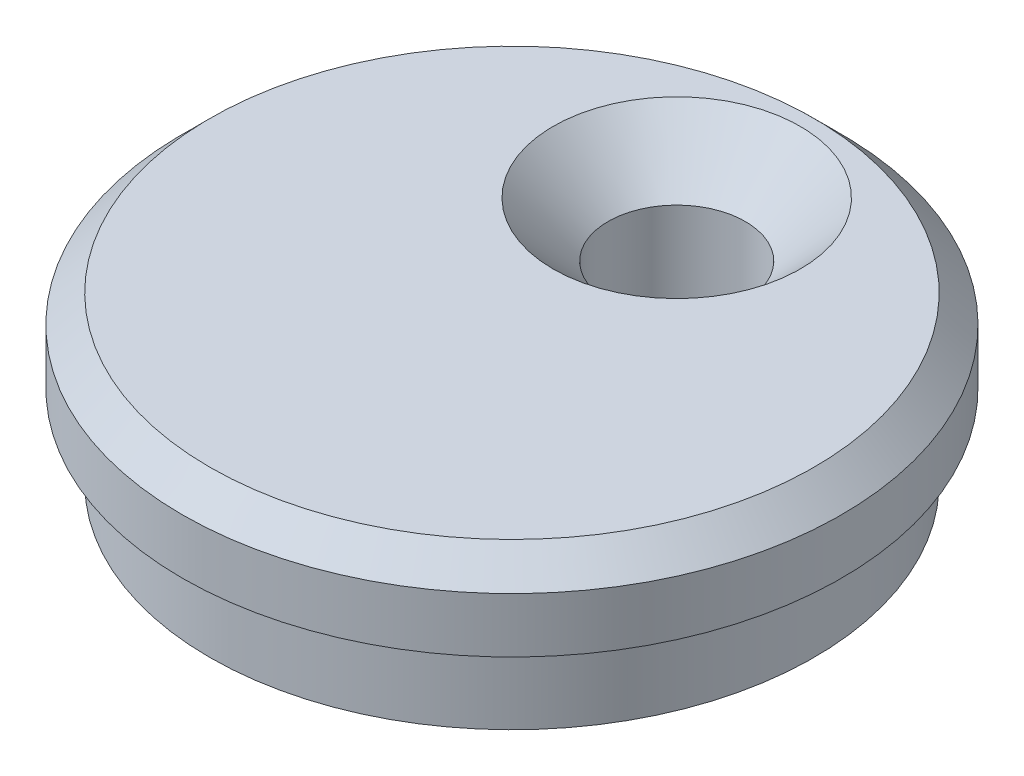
ISO-10303-21;
HEADER;
FILE_DESCRIPTION(('STEP AP214'),'2;1');
FILE_NAME('part.step','',(''),(''),'','','');
FILE_SCHEMA(('AUTOMOTIVE_DESIGN { 1 0 10303 214 1 1 1 1 }'));
ENDSEC;
DATA;
#1=APPLICATION_CONTEXT('core data for automotive mechanical design processes');
#2=APPLICATION_PROTOCOL_DEFINITION('international standard','automotive_design',2000,#1);
#3=PRODUCT_CONTEXT('',#1,'mechanical');
#4=PRODUCT('Part','Part','',(#3));
#5=PRODUCT_RELATED_PRODUCT_CATEGORY('part','',(#4));
#6=PRODUCT_DEFINITION_FORMATION('','',#4);
#7=PRODUCT_DEFINITION_CONTEXT('part definition',#1,'design');
#8=PRODUCT_DEFINITION('design','',#6,#7);
#9=PRODUCT_DEFINITION_SHAPE('','',#8);
#10=(LENGTH_UNIT() NAMED_UNIT(*) SI_UNIT(.MILLI.,.METRE.));
#11=(NAMED_UNIT(*) PLANE_ANGLE_UNIT() SI_UNIT($,.RADIAN.));
#12=(NAMED_UNIT(*) SI_UNIT($,.STERADIAN.) SOLID_ANGLE_UNIT());
#13=UNCERTAINTY_MEASURE_WITH_UNIT(LENGTH_MEASURE(1.E-05),#10,'distance_accuracy_value','');
#14=(GEOMETRIC_REPRESENTATION_CONTEXT(3) GLOBAL_UNCERTAINTY_ASSIGNED_CONTEXT((#13)) GLOBAL_UNIT_ASSIGNED_CONTEXT((#10,
#11,#12)) REPRESENTATION_CONTEXT('',''));
#15=CARTESIAN_POINT('',(0.,0.,0.));
#16=DIRECTION('',(0.,0.,1.));
#17=DIRECTION('',(1.,0.,0.));
#18=AXIS2_PLACEMENT_3D('',#15,#16,#17);
#19=CARTESIAN_POINT('',(0.,3.,0.));
#20=DIRECTION('',(0.,-1.,0.));
#21=DIRECTION('',(0.,0.,-1.));
#22=AXIS2_PLACEMENT_3D('',#19,#20,#21);
#23=CYLINDRICAL_SURFACE('',#22,11.);
#24=CARTESIAN_POINT('',(0.,3.,0.));
#25=DIRECTION('',(0.,1.,0.));
#26=DIRECTION('',(0.,0.,1.));
#27=AXIS2_PLACEMENT_3D('',#24,#25,#26);
#28=CIRCLE('',#27,11.);
#29=CARTESIAN_POINT('',(0.,3.,11.));
#30=VERTEX_POINT('',#29);
#31=EDGE_CURVE('E40',#30,#30,#28,.T.);
#32=ORIENTED_EDGE('',*,*,#31,.F.);
#33=EDGE_LOOP('',(#32));
#34=FACE_BOUND('',#33,.T.);
#35=CARTESIAN_POINT('',(0.,0.,0.));
#36=DIRECTION('',(0.,1.,0.));
#37=DIRECTION('',(0.,0.,1.));
#38=AXIS2_PLACEMENT_3D('',#35,#36,#37);
#39=CIRCLE('',#38,11.);
#40=CARTESIAN_POINT('',(0.,0.,11.));
#41=VERTEX_POINT('',#40);
#42=EDGE_CURVE('E44',#41,#41,#39,.T.);
#43=ORIENTED_EDGE('',*,*,#42,.T.);
#44=EDGE_LOOP('',(#43));
#45=FACE_BOUND('',#44,.T.);
#46=ADVANCED_FACE('F29',(#34,#45),#23,.T.);
#47=CARTESIAN_POINT('',(0.,0.,0.));
#48=DIRECTION('',(0.,1.,0.));
#49=DIRECTION('',(0.,0.,1.));
#50=AXIS2_PLACEMENT_3D('',#47,#48,#49);
#51=PLANE('',#50);
#52=CARTESIAN_POINT('',(0.,0.,-6.));
#53=DIRECTION('',(0.,1.,0.));
#54=DIRECTION('',(0.,0.,1.));
#55=AXIS2_PLACEMENT_3D('',#52,#53,#54);
#56=CIRCLE('',#55,2.5);
#57=CARTESIAN_POINT('',(0.,0.,-3.5));
#58=VERTEX_POINT('',#57);
#59=EDGE_CURVE('E52',#58,#58,#56,.T.);
#60=ORIENTED_EDGE('',*,*,#59,.T.);
#61=EDGE_LOOP('',(#60));
#62=FACE_BOUND('',#61,.T.);
#63=ORIENTED_EDGE('',*,*,#42,.F.);
#64=EDGE_LOOP('',(#63));
#65=FACE_BOUND('',#64,.T.);
#66=ADVANCED_FACE('F79',(#62,#65),#51,.F.);
#67=CARTESIAN_POINT('',(0.,3.,0.));
#68=DIRECTION('',(0.,1.,0.));
#69=DIRECTION('',(0.,0.,1.));
#70=AXIS2_PLACEMENT_3D('',#67,#68,#69);
#71=PLANE('',#70);
#72=CARTESIAN_POINT('',(0.,3.,0.));
#73=DIRECTION('',(0.,1.,0.));
#74=DIRECTION('',(0.,0.,1.));
#75=AXIS2_PLACEMENT_3D('',#72,#73,#74);
#76=CIRCLE('',#75,12.);
#77=CARTESIAN_POINT('',(0.,3.,12.));
#78=VERTEX_POINT('',#77);
#79=EDGE_CURVE('E48',#78,#78,#76,.T.);
#80=ORIENTED_EDGE('',*,*,#79,.F.);
#81=EDGE_LOOP('',(#80));
#82=FACE_BOUND('',#81,.T.);
#83=ORIENTED_EDGE('',*,*,#31,.T.);
#84=EDGE_LOOP('',(#83));
#85=FACE_BOUND('',#84,.T.);
#86=ADVANCED_FACE('F74',(#82,#85),#71,.F.);
#87=CARTESIAN_POINT('',(0.,6.,0.));
#88=DIRECTION('',(0.,-1.,0.));
#89=DIRECTION('',(0.,0.,-1.));
#90=AXIS2_PLACEMENT_3D('',#87,#88,#89);
#91=CYLINDRICAL_SURFACE('',#90,12.);
#92=CARTESIAN_POINT('',(0.,5.,0.));
#93=DIRECTION('',(0.,1.,0.));
#94=DIRECTION('',(0.,0.,1.));
#95=AXIS2_PLACEMENT_3D('',#92,#93,#94);
#96=CIRCLE('',#95,12.);
#97=CARTESIAN_POINT('',(0.,5.,12.));
#98=VERTEX_POINT('',#97);
#99=EDGE_CURVE('E10',#98,#98,#96,.F.);
#100=ORIENTED_EDGE('',*,*,#99,.T.);
#101=EDGE_LOOP('',(#100));
#102=FACE_BOUND('',#101,.T.);
#103=ORIENTED_EDGE('',*,*,#79,.T.);
#104=EDGE_LOOP('',(#103));
#105=FACE_BOUND('',#104,.T.);
#106=ADVANCED_FACE('F66',(#102,#105),#91,.T.);
#107=CARTESIAN_POINT('',(0.,6.,0.));
#108=DIRECTION('',(0.,1.,0.));
#109=DIRECTION('',(0.,0.,1.));
#110=AXIS2_PLACEMENT_3D('',#107,#108,#109);
#111=PLANE('',#110);
#112=CARTESIAN_POINT('',(0.,6.,-6.));
#113=DIRECTION('',(0.,1.,0.));
#114=DIRECTION('',(0.,0.,1.));
#115=AXIS2_PLACEMENT_3D('',#112,#113,#114);
#116=CIRCLE('',#115,4.5);
#117=CARTESIAN_POINT('',(0.,6.,-1.5));
#118=VERTEX_POINT('',#117);
#119=EDGE_CURVE('E58',#118,#118,#116,.T.);
#120=ORIENTED_EDGE('',*,*,#119,.F.);
#121=EDGE_LOOP('',(#120));
#122=FACE_BOUND('',#121,.T.);
#123=CARTESIAN_POINT('',(0.,6.,0.));
#124=DIRECTION('',(0.,1.,0.));
#125=DIRECTION('',(0.,0.,1.));
#126=AXIS2_PLACEMENT_3D('',#123,#124,#125);
#127=CIRCLE('',#126,11.);
#128=CARTESIAN_POINT('',(0.,6.,11.));
#129=VERTEX_POINT('',#128);
#130=EDGE_CURVE('E36',#129,#129,#127,.T.);
#131=ORIENTED_EDGE('',*,*,#130,.T.);
#132=EDGE_LOOP('',(#131));
#133=FACE_BOUND('',#132,.T.);
#134=ADVANCED_FACE('F64',(#122,#133),#111,.T.);
#135=CARTESIAN_POINT('',(0.,6.,0.));
#136=DIRECTION('',(0.,-1.,0.));
#137=DIRECTION('',(0.,0.,-1.));
#138=AXIS2_PLACEMENT_3D('',#135,#136,#137);
#139=CONICAL_SURFACE('',#138,11.,0.785398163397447);
#140=ORIENTED_EDGE('',*,*,#99,.F.);
#141=EDGE_LOOP('',(#140));
#142=FACE_BOUND('',#141,.T.);
#143=ORIENTED_EDGE('',*,*,#130,.F.);
#144=EDGE_LOOP('',(#143));
#145=FACE_BOUND('',#144,.T.);
#146=ADVANCED_FACE('F31',(#142,#145),#139,.T.);
#147=CARTESIAN_POINT('',(0.,6.,-6.));
#148=DIRECTION('',(0.,1.,0.));
#149=DIRECTION('',(0.,0.,1.));
#150=AXIS2_PLACEMENT_3D('',#147,#148,#149);
#151=CYLINDRICAL_SURFACE('',#150,2.5);
#152=ORIENTED_EDGE('',*,*,#59,.F.);
#153=EDGE_LOOP('',(#152));
#154=FACE_BOUND('',#153,.T.);
#155=CARTESIAN_POINT('',(0.,4.,-6.));
#156=DIRECTION('',(0.,1.,0.));
#157=DIRECTION('',(0.,0.,1.));
#158=AXIS2_PLACEMENT_3D('',#155,#156,#157);
#159=CIRCLE('',#158,2.5);
#160=CARTESIAN_POINT('',(0.,4.,-3.5));
#161=VERTEX_POINT('',#160);
#162=EDGE_CURVE('E55',#161,#161,#159,.T.);
#163=ORIENTED_EDGE('',*,*,#162,.T.);
#164=EDGE_LOOP('',(#163));
#165=FACE_BOUND('',#164,.T.);
#166=ADVANCED_FACE('F72',(#154,#165),#151,.F.);
#167=CARTESIAN_POINT('',(0.,6.,-6.));
#168=DIRECTION('',(0.,1.,0.));
#169=DIRECTION('',(0.,0.,1.));
#170=AXIS2_PLACEMENT_3D('',#167,#168,#169);
#171=CONICAL_SURFACE('',#170,4.5,0.785398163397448);
#172=ORIENTED_EDGE('',*,*,#162,.F.);
#173=EDGE_LOOP('',(#172));
#174=FACE_BOUND('',#173,.T.);
#175=ORIENTED_EDGE('',*,*,#119,.T.);
#176=EDGE_LOOP('',(#175));
#177=FACE_BOUND('',#176,.T.);
#178=ADVANCED_FACE('F62',(#174,#177),#171,.F.);
#179=CLOSED_SHELL('',(#46,#66,#86,#106,#134,#146,#166,#178));
#180=MANIFOLD_SOLID_BREP('B2',#179);
#181=ADVANCED_BREP_SHAPE_REPRESENTATION('',(#18,#180),#14);
#182=SHAPE_DEFINITION_REPRESENTATION(#9,#181);
ENDSEC;
END-ISO-10303-21;
